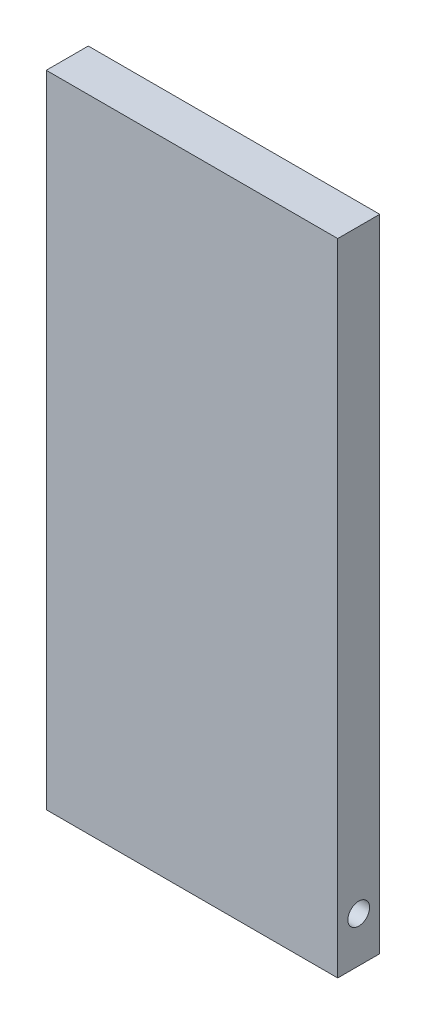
from build123d import *

# Parameters (mm, degrees)
SKETCH1_W          = 69.360791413
SKETCH1_H          = 152.4
EXTRUDE1_DEPTH     = 5
SKETCH2_R          = 2.579000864
CUT_EXTRUDE1_DEPTH = 158.781692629


with BuildPart() as part:
    # Sketch1 → Extrude1 (new, symmetric)
    with BuildSketch(Plane.XY):
        with Locations((32.704304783, 65.430304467)):
            Rectangle(SKETCH1_W, SKETCH1_H)
    extrude(amount=EXTRUDE1_DEPTH, both=True)

    # Sketch2 → Cut-Extrude1 (cut, through all)
    with BuildSketch(Plane(origin=(67.38470049, 0, 0), x_dir=(0, 0, -1), z_dir=(1, 0, 0))):
        with Locations(Location((0, 0, 0), (0, 0, 90))):
            Circle(SKETCH2_R)
    extrude(amount=-CUT_EXTRUDE1_DEPTH, mode=Mode.SUBTRACT)


solid = part.part
